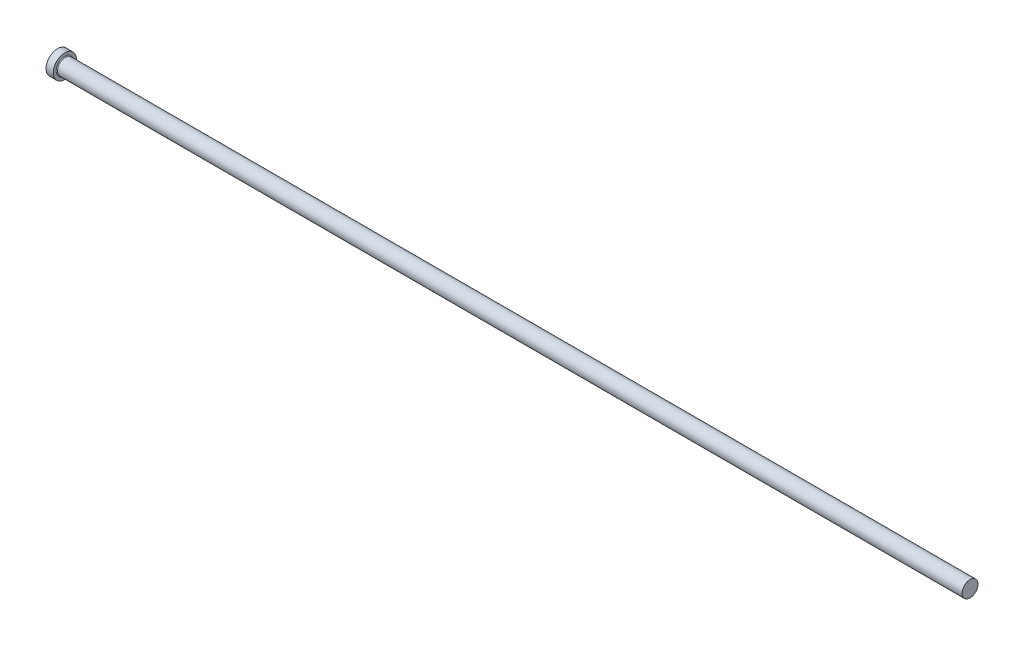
ISO-10303-21;
HEADER;
FILE_DESCRIPTION(('STEP AP214'),'2;1');
FILE_NAME('part.step','',(''),(''),'','','');
FILE_SCHEMA(('AUTOMOTIVE_DESIGN { 1 0 10303 214 1 1 1 1 }'));
ENDSEC;
DATA;
#1=APPLICATION_CONTEXT('core data for automotive mechanical design processes');
#2=APPLICATION_PROTOCOL_DEFINITION('international standard','automotive_design',2000,#1);
#3=PRODUCT_CONTEXT('',#1,'mechanical');
#4=PRODUCT('Part','Part','',(#3));
#5=PRODUCT_RELATED_PRODUCT_CATEGORY('part','',(#4));
#6=PRODUCT_DEFINITION_FORMATION('','',#4);
#7=PRODUCT_DEFINITION_CONTEXT('part definition',#1,'design');
#8=PRODUCT_DEFINITION('design','',#6,#7);
#9=PRODUCT_DEFINITION_SHAPE('','',#8);
#10=(LENGTH_UNIT() NAMED_UNIT(*) SI_UNIT(.MILLI.,.METRE.));
#11=(NAMED_UNIT(*) PLANE_ANGLE_UNIT() SI_UNIT($,.RADIAN.));
#12=(NAMED_UNIT(*) SI_UNIT($,.STERADIAN.) SOLID_ANGLE_UNIT());
#13=UNCERTAINTY_MEASURE_WITH_UNIT(LENGTH_MEASURE(1.E-05),#10,'distance_accuracy_value','');
#14=(GEOMETRIC_REPRESENTATION_CONTEXT(3) GLOBAL_UNCERTAINTY_ASSIGNED_CONTEXT((#13)) GLOBAL_UNIT_ASSIGNED_CONTEXT((#10,
#11,#12)) REPRESENTATION_CONTEXT('',''));
#15=CARTESIAN_POINT('',(0.,0.,0.));
#16=DIRECTION('',(0.,0.,1.));
#17=DIRECTION('',(1.,0.,0.));
#18=AXIS2_PLACEMENT_3D('',#15,#16,#17);
#19=CARTESIAN_POINT('',(0.,0.,0.));
#20=DIRECTION('',(-1.,0.,0.));
#21=DIRECTION('',(0.,-1.,0.));
#22=AXIS2_PLACEMENT_3D('',#19,#20,#21);
#23=PLANE('',#22);
#24=CARTESIAN_POINT('',(0.,0.,0.));
#25=DIRECTION('',(1.,0.,0.));
#26=DIRECTION('',(0.,1.,0.));
#27=AXIS2_PLACEMENT_3D('',#24,#25,#26);
#28=CIRCLE('',#27,8.);
#29=CARTESIAN_POINT('',(0.,8.,0.));
#30=VERTEX_POINT('',#29);
#31=EDGE_CURVE('E25',#30,#30,#28,.T.);
#32=ORIENTED_EDGE('',*,*,#31,.F.);
#33=EDGE_LOOP('',(#32));
#34=FACE_BOUND('',#33,.T.);
#35=ADVANCED_FACE('F14',(#34),#23,.T.);
#36=CARTESIAN_POINT('',(630.,0.,0.));
#37=DIRECTION('',(1.,0.,0.));
#38=DIRECTION('',(0.,1.,0.));
#39=AXIS2_PLACEMENT_3D('',#36,#37,#38);
#40=CYLINDRICAL_SURFACE('',#39,8.);
#41=ORIENTED_EDGE('',*,*,#31,.T.);
#42=EDGE_LOOP('',(#41));
#43=FACE_BOUND('',#42,.T.);
#44=CARTESIAN_POINT('',(5.,0.,0.));
#45=DIRECTION('',(1.,0.,0.));
#46=DIRECTION('',(0.,1.,0.));
#47=AXIS2_PLACEMENT_3D('',#44,#45,#46);
#48=CIRCLE('',#47,8.);
#49=CARTESIAN_POINT('',(5.,8.,0.));
#50=VERTEX_POINT('',#49);
#51=EDGE_CURVE('E29',#50,#50,#48,.T.);
#52=ORIENTED_EDGE('',*,*,#51,.F.);
#53=EDGE_LOOP('',(#52));
#54=FACE_BOUND('',#53,.T.);
#55=ADVANCED_FACE('F51',(#43,#54),#40,.T.);
#56=CARTESIAN_POINT('',(5.,8.,0.));
#57=DIRECTION('',(1.,0.,0.));
#58=DIRECTION('',(0.,1.,0.));
#59=AXIS2_PLACEMENT_3D('',#56,#57,#58);
#60=PLANE('',#59);
#61=CARTESIAN_POINT('',(5.,0.,0.));
#62=DIRECTION('',(1.,0.,0.));
#63=DIRECTION('',(0.,1.,0.));
#64=AXIS2_PLACEMENT_3D('',#61,#62,#63);
#65=CIRCLE('',#64,5.99999999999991);
#66=CARTESIAN_POINT('',(5.,5.99999999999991,0.));
#67=VERTEX_POINT('',#66);
#68=EDGE_CURVE('E9',#67,#67,#65,.F.);
#69=ORIENTED_EDGE('',*,*,#68,.T.);
#70=EDGE_LOOP('',(#69));
#71=FACE_BOUND('',#70,.T.);
#72=ORIENTED_EDGE('',*,*,#51,.T.);
#73=EDGE_LOOP('',(#72));
#74=FACE_BOUND('',#73,.T.);
#75=ADVANCED_FACE('F42',(#71,#74),#60,.T.);
#76=CARTESIAN_POINT('',(630.,0.,0.));
#77=DIRECTION('',(1.,0.,0.));
#78=DIRECTION('',(0.,1.,0.));
#79=AXIS2_PLACEMENT_3D('',#76,#77,#78);
#80=CYLINDRICAL_SURFACE('',#79,5.49999999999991);
#81=CARTESIAN_POINT('',(5.5,0.,0.));
#82=DIRECTION('',(1.,0.,0.));
#83=DIRECTION('',(0.,1.,0.));
#84=AXIS2_PLACEMENT_3D('',#81,#82,#83);
#85=CIRCLE('',#84,5.49999999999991);
#86=CARTESIAN_POINT('',(5.5,5.49999999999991,0.));
#87=VERTEX_POINT('',#86);
#88=EDGE_CURVE('E21',#87,#87,#85,.T.);
#89=ORIENTED_EDGE('',*,*,#88,.T.);
#90=EDGE_LOOP('',(#89));
#91=FACE_BOUND('',#90,.T.);
#92=CARTESIAN_POINT('',(630.,0.,0.));
#93=DIRECTION('',(1.,0.,0.));
#94=DIRECTION('',(0.,1.,0.));
#95=AXIS2_PLACEMENT_3D('',#92,#93,#94);
#96=CIRCLE('',#95,5.49999999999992);
#97=CARTESIAN_POINT('',(630.,5.49999999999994,0.));
#98=VERTEX_POINT('',#97);
#99=EDGE_CURVE('E34',#98,#98,#96,.T.);
#100=ORIENTED_EDGE('',*,*,#99,.F.);
#101=EDGE_LOOP('',(#100));
#102=FACE_BOUND('',#101,.T.);
#103=ADVANCED_FACE('F40',(#91,#102),#80,.T.);
#104=CARTESIAN_POINT('',(630.,5.49999999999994,0.));
#105=DIRECTION('',(1.,0.,0.));
#106=DIRECTION('',(0.,1.,0.));
#107=AXIS2_PLACEMENT_3D('',#104,#105,#106);
#108=PLANE('',#107);
#109=ORIENTED_EDGE('',*,*,#99,.T.);
#110=EDGE_LOOP('',(#109));
#111=FACE_BOUND('',#110,.T.);
#112=ADVANCED_FACE('F38',(#111),#108,.T.);
#113=CARTESIAN_POINT('',(5.5,0.,0.));
#114=DIRECTION('',(1.,0.,0.));
#115=DIRECTION('',(0.,1.,0.));
#116=AXIS2_PLACEMENT_3D('',#113,#114,#115);
#117=TOROIDAL_SURFACE('',#116,5.99999999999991,0.5);
#118=ORIENTED_EDGE('',*,*,#68,.F.);
#119=EDGE_LOOP('',(#118));
#120=FACE_BOUND('',#119,.T.);
#121=ORIENTED_EDGE('',*,*,#88,.F.);
#122=EDGE_LOOP('',(#121));
#123=FACE_BOUND('',#122,.T.);
#124=ADVANCED_FACE('F16',(#120,#123),#117,.F.);
#125=CLOSED_SHELL('',(#35,#55,#75,#103,#112,#124));
#126=MANIFOLD_SOLID_BREP('B1',#125);
#127=ADVANCED_BREP_SHAPE_REPRESENTATION('',(#18,#126),#14);
#128=SHAPE_DEFINITION_REPRESENTATION(#9,#127);
ENDSEC;
END-ISO-10303-21;
